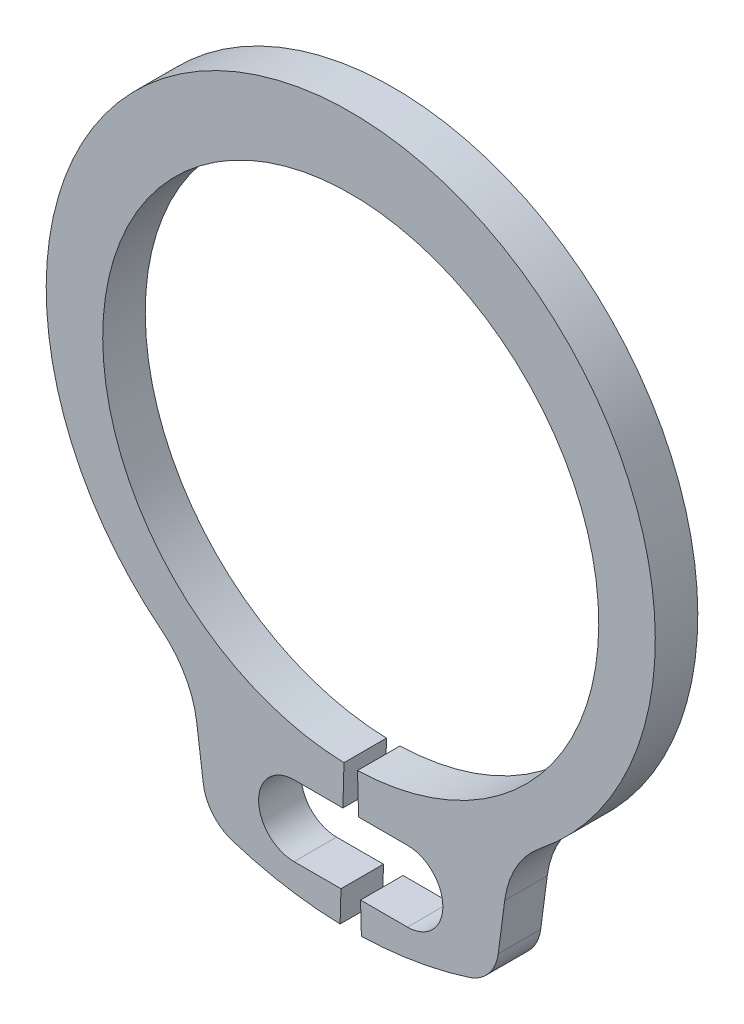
from build123d import *

# Parameters (mm, degrees)
BODYSKE_R   = 0.3175
BODY_DEPTH  = 0.381
NOTSKE_W    = 1.016
NOTSKE_H    = 0.635
NOTCH_DEPTH = 0.381


with BuildPart() as part:
    # BodySke → Body (new body)
    with BuildSketch(Plane.XY):
        with BuildLine():
            Line((0.060613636, -2.221673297), (0.09525, -3.491200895))
            ThreePointArc((0.09525, -3.491200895), (0.582829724, -3.443525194), (1.058941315, -3.328092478))
            ThreePointArc((1.058941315, -3.328092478), (1.235604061, -3.209547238), (1.321160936, -3.014758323))
            Line((1.321160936, -3.014758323), (1.379639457, -2.570569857))
            ThreePointArc((1.379639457, -2.570569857), (1.484225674, -2.258055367), (1.698295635, -2.007500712))
            ThreePointArc((1.698295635, -2.007500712), (0, 2.8575), (-1.698295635, -2.007500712))
            ThreePointArc((-1.698295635, -2.007500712), (-1.484225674, -2.258055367), (-1.379639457, -2.570569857))
            Line((-1.379639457, -2.570569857), (-1.321160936, -3.014758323))
            ThreePointArc((-1.321160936, -3.014758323), (-1.235604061, -3.209547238), (-1.058941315, -3.328092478))
            ThreePointArc((-1.058941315, -3.328092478), (-0.582829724, -3.443525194), (-0.09525, -3.491200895))
            Line((-0.09525, -3.491200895), (-0.060613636, -2.221673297))
            ThreePointArc((-0.060613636, -2.221673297), (0, 2.2225), (0.060613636, -2.221673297))
        make_face()
        with Locations((0.508, -2.895829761)):
            Circle(BODYSKE_R, mode=Mode.SUBTRACT)
        with Locations((-0.508, -2.895829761)):
            Circle(BODYSKE_R, mode=Mode.SUBTRACT)
    extrude(amount=-BODY_DEPTH)

    # NotSke → Notch (cut)
    with BuildSketch(Plane.XY):
        with Locations((0, -2.895829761)):
            Rectangle(NOTSKE_W, NOTSKE_H)
    extrude(amount=-NOTCH_DEPTH, mode=Mode.SUBTRACT)


solid = part.part
